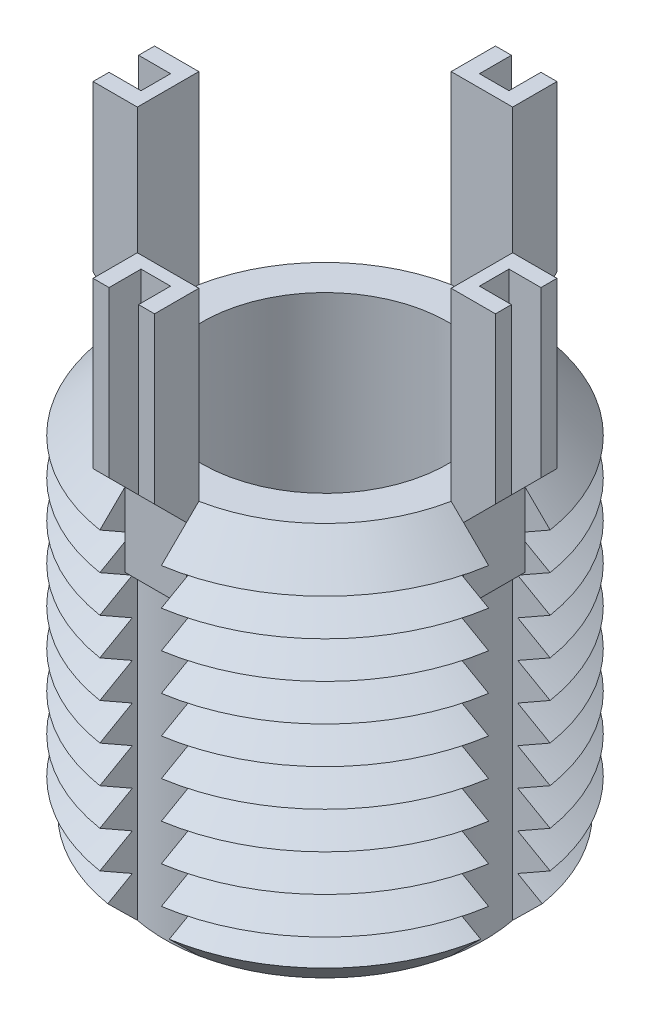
from build123d import *

# Parameters (mm, degrees)
SKETCH1_R               = 8
BOSS_EXTRUDE1_DEPTH     = 16
CHAMFER1_SIZE           = 1.5
LPATTERN1_COUNT         = 9
LPATTERN1_PITCH         = 1.5
CUT_EXTRUDE1_REACH      = 21.596
CIRPATTERN1_COUNT       = 4
BOSS_EXTRUDE3_DEPTH     = 1.25
CIRPATTERN2_COUNT       = 4
CUT_EXTRUDE3_DEPTH      = 27.192202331
CUT_EXTRUDE3_DEPTH_BACK = 27.192202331
SKETCH6_W               = 1.3
SKETCH6_H               = 1.2
SKETCH6_W_2             = 1.2
SKETCH6_H_2             = 1.3
SKETCH7_R               = 5
CUT_EXTRUDE4_DEPTH      = 16


with BuildPart() as part:
    # Sketch1 → Boss-Extrude1 (new body)
    with BuildSketch(Plane(origin=(0, 0, 0), x_dir=(1, 0, 0), z_dir=(0, 1, 0))):
        with Locations(Location((0, 0, 0), (0, 0, 270))):
            Circle(SKETCH1_R)
    extrude(amount=-BOSS_EXTRUDE1_DEPTH)

    # Chamfer1
    chamfer1_edges = [part.edges().sort_by_distance(p)[0] for p in [
        (0, 0, -8),
        (0, -16, -8),
    ]]
    chamfer(chamfer1_edges, length=CHAMFER1_SIZE)

    # Sketch3 → Cut-Revolve1 (revolve, cut)
    with BuildSketch(Plane(origin=(0, 0, 0), x_dir=(0, 0, -1), z_dir=(1, 0, 0))):
        Polygon((-8, -1.5), (-6.700961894, -2.25), (-8, -3), align=None)
    cut_revolve1 = revolve(axis=Axis((0, 0.885892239, 0), (0, -1, 0)), mode=Mode.SUBTRACT)

    # LPattern1: Cut-Revolve1 ×9
    with Locations(*[(0, -i * LPATTERN1_PITCH, 0) for i in range(1, LPATTERN1_COUNT)]):
        add(cut_revolve1, mode=Mode.SUBTRACT)

    # Cut-Extrude1: up to this cone (the profile starts inside it)
    cut_extrude1_end = Plane(origin=(0, 0, 0), z_dir=(0, 1, 0)).offset(-22.499999) * Cone(1e-06, 67.096, 67.095999, align=(Align.CENTER, Align.CENTER, Align.MIN), mode=Mode.PRIVATE)
    # Sketch4 → Cut-Extrude1 (cut, up to the surface)
    with BuildSketch(Plane(origin=(0, 0, 0), x_dir=(1, 0, 0), z_dir=(0, 1, 0)), mode=Mode.PRIVATE) as cut_extrude1_sk1:
        with BuildLine():
            Line((-6.378675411, 1.25), (-7.901740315, 1.25))
            ThreePointArc((-7.901740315, 1.25), (-8, 0), (-7.901740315, -1.25))
            Line((-7.901740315, -1.25), (-6.378675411, -1.25))
            ThreePointArc((-6.378675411, -1.25), (-6.5, 0), (-6.378675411, 1.25))
        make_face()
    cut_extrude1_tool1 = extrude(cut_extrude1_sk1.sketch, amount=-CUT_EXTRUDE1_REACH, mode=Mode.PRIVATE) & cut_extrude1_end
    cut_extrude1 = cut_extrude1_tool1.solids().sort_by_distance((-7.213371, 0, 0))[0]
    add(cut_extrude1, mode=Mode.SUBTRACT)

    # CirPattern1: Cut-Extrude1 ×4 about axis
    cirpattern1_axis = Axis((0, 0, 0), (0, 1, 0))
    for i in range(1, CIRPATTERN1_COUNT):
        add(cut_extrude1.rotate(cirpattern1_axis, i * 360 / CIRPATTERN1_COUNT), mode=Mode.SUBTRACT)

    # Sketch5 → Boss-Extrude3 (add, symmetric)
    with BuildSketch(Plane(origin=(0, 0, 0), x_dir=(0, 0, -1), z_dir=(1, 0, 0))):
        Polygon((-6.378675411, 7.5), (-6.378675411, -3.5), (-6.878675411, -3.5), (-6.878675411, -0.5), (-8.178675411, 0.8), (-8.178675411, 7.5), align=None)
    boss_extrude3 = extrude(amount=BOSS_EXTRUDE3_DEPTH, both=True)

    # CirPattern2: Boss-Extrude3 ×4 about axis
    cirpattern2_axis = Axis((0, 0, 0), (0, 1, 0))
    for i in range(1, CIRPATTERN2_COUNT):
        add(boss_extrude3.rotate(cirpattern2_axis, i * 360 / CIRPATTERN2_COUNT))

    # Sketch6 → Cut-Extrude3 (cut, two sides: drawn at the far end of the back side and taken through both)
    with BuildSketch(Plane(origin=(0, 7.5, 0), x_dir=(1, 0, 0), z_dir=(0, 1, 0)).offset(-CUT_EXTRUDE3_DEPTH_BACK)):
        with Locations((-7.528675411, 0)):
            Rectangle(SKETCH6_W, SKETCH6_H)
        with Locations((0, 7.528675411)):
            Rectangle(SKETCH6_W_2, SKETCH6_H_2)
        with Locations((7.528675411, 0)):
            Rectangle(SKETCH6_W, SKETCH6_H)
        with Locations((0, -7.528675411)):
            Rectangle(SKETCH6_W_2, SKETCH6_H_2)
    extrude(amount=CUT_EXTRUDE3_DEPTH + CUT_EXTRUDE3_DEPTH_BACK, mode=Mode.SUBTRACT)

    # Sketch7 → Cut-Extrude4 (cut)
    with BuildSketch(Plane(origin=(0, 0, 0), x_dir=(1, 0, 0), z_dir=(0, 1, 0))):
        with Locations(Location((0, 0, 0), (0, 0, 270))):
            Circle(SKETCH7_R)
    extrude(amount=-CUT_EXTRUDE4_DEPTH, mode=Mode.SUBTRACT)


solid = part.part
